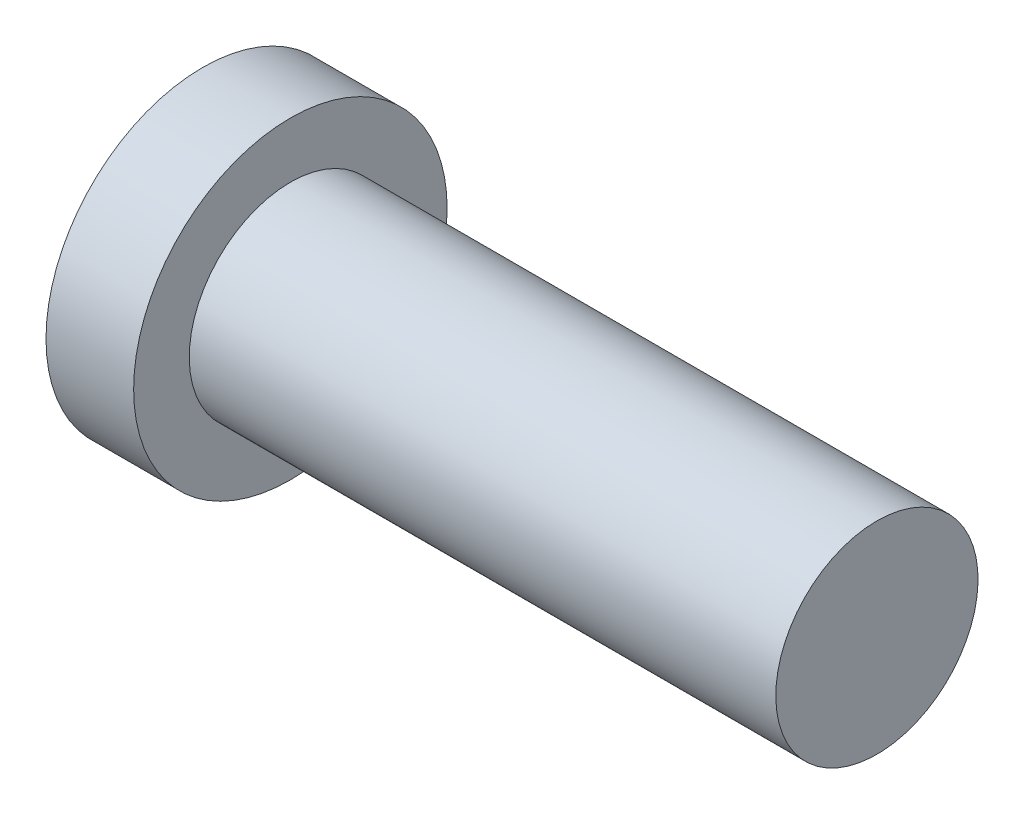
ISO-10303-21;
HEADER;
FILE_DESCRIPTION(('STEP AP214'),'2;1');
FILE_NAME('part.step','',(''),(''),'','','');
FILE_SCHEMA(('AUTOMOTIVE_DESIGN { 1 0 10303 214 1 1 1 1 }'));
ENDSEC;
DATA;
#1=APPLICATION_CONTEXT('core data for automotive mechanical design processes');
#2=APPLICATION_PROTOCOL_DEFINITION('international standard','automotive_design',2000,#1);
#3=PRODUCT_CONTEXT('',#1,'mechanical');
#4=PRODUCT('Part','Part','',(#3));
#5=PRODUCT_RELATED_PRODUCT_CATEGORY('part','',(#4));
#6=PRODUCT_DEFINITION_FORMATION('','',#4);
#7=PRODUCT_DEFINITION_CONTEXT('part definition',#1,'design');
#8=PRODUCT_DEFINITION('design','',#6,#7);
#9=PRODUCT_DEFINITION_SHAPE('','',#8);
#10=(LENGTH_UNIT() NAMED_UNIT(*) SI_UNIT(.MILLI.,.METRE.));
#11=(NAMED_UNIT(*) PLANE_ANGLE_UNIT() SI_UNIT($,.RADIAN.));
#12=(NAMED_UNIT(*) SI_UNIT($,.STERADIAN.) SOLID_ANGLE_UNIT());
#13=UNCERTAINTY_MEASURE_WITH_UNIT(LENGTH_MEASURE(1.E-05),#10,'distance_accuracy_value','');
#14=(GEOMETRIC_REPRESENTATION_CONTEXT(3) GLOBAL_UNCERTAINTY_ASSIGNED_CONTEXT((#13)) GLOBAL_UNIT_ASSIGNED_CONTEXT((#10,
#11,#12)) REPRESENTATION_CONTEXT('',''));
#15=CARTESIAN_POINT('',(0.,0.,0.));
#16=DIRECTION('',(0.,0.,1.));
#17=DIRECTION('',(1.,0.,0.));
#18=AXIS2_PLACEMENT_3D('',#15,#16,#17);
#19=CARTESIAN_POINT('',(10.7333766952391,-1.5,0.));
#20=DIRECTION('',(-1.,0.,0.));
#21=DIRECTION('',(0.,-1.,0.));
#22=AXIS2_PLACEMENT_3D('',#19,#20,#21);
#23=PLANE('',#22);
#24=CARTESIAN_POINT('',(10.7333766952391,0.,0.));
#25=DIRECTION('',(1.,0.,0.));
#26=DIRECTION('',(0.,1.,0.));
#27=AXIS2_PLACEMENT_3D('',#24,#25,#26);
#28=CIRCLE('',#27,1.5);
#29=CARTESIAN_POINT('',(10.7333766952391,1.5,0.));
#30=VERTEX_POINT('',#29);
#31=EDGE_CURVE('E10',#30,#30,#28,.T.);
#32=ORIENTED_EDGE('',*,*,#31,.T.);
#33=EDGE_LOOP('',(#32));
#34=FACE_BOUND('',#33,.T.);
#35=ADVANCED_FACE('F30',(#34),#23,.F.);
#36=CARTESIAN_POINT('',(28.9873686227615,0.,0.));
#37=DIRECTION('',(1.,0.,0.));
#38=DIRECTION('',(0.,1.,0.));
#39=AXIS2_PLACEMENT_3D('',#36,#37,#38);
#40=CYLINDRICAL_SURFACE('',#39,1.5);
#41=ORIENTED_EDGE('',*,*,#31,.F.);
#42=EDGE_LOOP('',(#41));
#43=FACE_BOUND('',#42,.T.);
#44=CARTESIAN_POINT('',(2.03337669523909,0.,0.));
#45=DIRECTION('',(1.,0.,0.));
#46=DIRECTION('',(0.,1.,0.));
#47=AXIS2_PLACEMENT_3D('',#44,#45,#46);
#48=CIRCLE('',#47,1.5);
#49=CARTESIAN_POINT('',(2.03337669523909,1.5,0.));
#50=VERTEX_POINT('',#49);
#51=EDGE_CURVE('E36',#50,#50,#48,.T.);
#52=ORIENTED_EDGE('',*,*,#51,.T.);
#53=EDGE_LOOP('',(#52));
#54=FACE_BOUND('',#53,.T.);
#55=ADVANCED_FACE('F71',(#43,#54),#40,.T.);
#56=CARTESIAN_POINT('',(2.03337669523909,-2.325,0.));
#57=DIRECTION('',(-1.,0.,0.));
#58=DIRECTION('',(0.,-1.,0.));
#59=AXIS2_PLACEMENT_3D('',#56,#57,#58);
#60=PLANE('',#59);
#61=ORIENTED_EDGE('',*,*,#51,.F.);
#62=EDGE_LOOP('',(#61));
#63=FACE_BOUND('',#62,.T.);
#64=CARTESIAN_POINT('',(2.03337669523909,0.,0.));
#65=DIRECTION('',(1.,0.,0.));
#66=DIRECTION('',(0.,1.,0.));
#67=AXIS2_PLACEMENT_3D('',#64,#65,#66);
#68=CIRCLE('',#67,2.325);
#69=CARTESIAN_POINT('',(2.03337669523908,2.325,0.));
#70=VERTEX_POINT('',#69);
#71=EDGE_CURVE('E40',#70,#70,#68,.T.);
#72=ORIENTED_EDGE('',*,*,#71,.T.);
#73=EDGE_LOOP('',(#72));
#74=FACE_BOUND('',#73,.T.);
#75=ADVANCED_FACE('F75',(#63,#74),#60,.F.);
#76=CARTESIAN_POINT('',(28.9873686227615,0.,0.));
#77=DIRECTION('',(1.,0.,0.));
#78=DIRECTION('',(0.,1.,0.));
#79=AXIS2_PLACEMENT_3D('',#76,#77,#78);
#80=CYLINDRICAL_SURFACE('',#79,2.325);
#81=ORIENTED_EDGE('',*,*,#71,.F.);
#82=EDGE_LOOP('',(#81));
#83=FACE_BOUND('',#82,.T.);
#84=CARTESIAN_POINT('',(0.733376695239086,0.,0.));
#85=DIRECTION('',(1.,0.,0.));
#86=DIRECTION('',(0.,1.,0.));
#87=AXIS2_PLACEMENT_3D('',#84,#85,#86);
#88=CIRCLE('',#87,2.325);
#89=CARTESIAN_POINT('',(0.733376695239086,2.325,0.));
#90=VERTEX_POINT('',#89);
#91=EDGE_CURVE('E44',#90,#90,#88,.T.);
#92=ORIENTED_EDGE('',*,*,#91,.T.);
#93=EDGE_LOOP('',(#92));
#94=FACE_BOUND('',#93,.T.);
#95=ADVANCED_FACE('F80',(#83,#94),#80,.T.);
#96=CARTESIAN_POINT('',(0.554941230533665,0.,0.));
#97=DIRECTION('',(1.,0.,0.));
#98=DIRECTION('',(0.,1.,0.));
#99=AXIS2_PLACEMENT_3D('',#96,#97,#98);
#100=CONICAL_SURFACE('',#99,0.627299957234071,1.46607657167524);
#101=CARTESIAN_POINT('',(0.554941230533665,0.,0.));
#102=DIRECTION('',(1.,0.,0.));
#103=DIRECTION('',(0.,1.,0.));
#104=AXIS2_PLACEMENT_3D('',#101,#102,#103);
#105=CIRCLE('',#104,0.627299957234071);
#106=CARTESIAN_POINT('',(0.554941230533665,0.627299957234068,0.));
#107=VERTEX_POINT('',#106);
#108=EDGE_CURVE('E49',#107,#107,#105,.T.);
#109=CARTESIAN_POINT('',(0.733376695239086,2.325,0.));
#110=CARTESIAN_POINT('',(0.731517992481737,2.30731562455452,0.));
#111=CARTESIAN_POINT('',(0.729659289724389,2.28963124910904,0.));
#112=CARTESIAN_POINT('',(0.725941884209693,2.25426249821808,0.));
#113=CARTESIAN_POINT('',(0.724083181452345,2.2365781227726,0.));
#114=CARTESIAN_POINT('',(0.720365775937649,2.20120937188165,0.));
#115=CARTESIAN_POINT('',(0.7185070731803,2.18352499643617,0.));
#116=CARTESIAN_POINT('',(0.714789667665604,2.14815624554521,0.));
#117=CARTESIAN_POINT('',(0.712930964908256,2.13047187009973,0.));
#118=CARTESIAN_POINT('',(0.70921355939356,2.09510311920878,0.));
#119=CARTESIAN_POINT('',(0.707354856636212,2.0774187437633,0.));
#120=CARTESIAN_POINT('',(0.703637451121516,2.04204999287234,0.));
#121=CARTESIAN_POINT('',(0.701778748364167,2.02436561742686,0.));
#122=CARTESIAN_POINT('',(0.698061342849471,1.98899686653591,0.));
#123=CARTESIAN_POINT('',(0.696202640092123,1.97131249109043,0.));
#124=CARTESIAN_POINT('',(0.692485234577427,1.93594374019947,0.));
#125=CARTESIAN_POINT('',(0.690626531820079,1.91825936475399,0.));
#126=CARTESIAN_POINT('',(0.686909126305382,1.88289061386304,0.));
#127=CARTESIAN_POINT('',(0.685050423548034,1.86520623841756,0.));
#128=CARTESIAN_POINT('',(0.681333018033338,1.8298374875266,0.));
#129=CARTESIAN_POINT('',(0.67947431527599,1.81215311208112,0.));
#130=CARTESIAN_POINT('',(0.675756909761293,1.77678436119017,0.));
#131=CARTESIAN_POINT('',(0.673898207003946,1.75909998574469,0.));
#132=CARTESIAN_POINT('',(0.670180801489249,1.72373123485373,0.));
#133=CARTESIAN_POINT('',(0.668322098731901,1.70604685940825,0.));
#134=CARTESIAN_POINT('',(0.664604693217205,1.67067810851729,0.));
#135=CARTESIAN_POINT('',(0.662745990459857,1.65299373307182,0.));
#136=CARTESIAN_POINT('',(0.65902858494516,1.61762498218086,0.));
#137=CARTESIAN_POINT('',(0.657169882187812,1.59994060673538,0.));
#138=CARTESIAN_POINT('',(0.653452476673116,1.56457185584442,0.));
#139=CARTESIAN_POINT('',(0.651593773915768,1.54688748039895,0.));
#140=CARTESIAN_POINT('',(0.647876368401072,1.51151872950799,0.));
#141=CARTESIAN_POINT('',(0.646017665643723,1.49383435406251,0.));
#142=CARTESIAN_POINT('',(0.642300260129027,1.45846560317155,0.));
#143=CARTESIAN_POINT('',(0.640441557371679,1.44078122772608,0.));
#144=CARTESIAN_POINT('',(0.636724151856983,1.40541247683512,0.));
#145=CARTESIAN_POINT('',(0.634865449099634,1.38772810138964,0.));
#146=CARTESIAN_POINT('',(0.631148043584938,1.35235935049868,0.));
#147=CARTESIAN_POINT('',(0.62928934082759,1.3346749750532,0.));
#148=CARTESIAN_POINT('',(0.625571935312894,1.29930622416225,0.));
#149=CARTESIAN_POINT('',(0.623713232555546,1.28162184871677,0.));
#150=CARTESIAN_POINT('',(0.619995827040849,1.24625309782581,0.));
#151=CARTESIAN_POINT('',(0.618137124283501,1.22856872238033,0.));
#152=CARTESIAN_POINT('',(0.614419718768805,1.19319997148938,0.));
#153=CARTESIAN_POINT('',(0.612561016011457,1.1755155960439,0.));
#154=CARTESIAN_POINT('',(0.608843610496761,1.14014684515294,0.));
#155=CARTESIAN_POINT('',(0.606984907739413,1.12246246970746,0.));
#156=CARTESIAN_POINT('',(0.603267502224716,1.08709371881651,0.));
#157=CARTESIAN_POINT('',(0.601408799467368,1.06940934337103,0.));
#158=CARTESIAN_POINT('',(0.597691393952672,1.03404059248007,0.));
#159=CARTESIAN_POINT('',(0.595832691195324,1.01635621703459,0.));
#160=CARTESIAN_POINT('',(0.592115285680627,0.980987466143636,0.));
#161=CARTESIAN_POINT('',(0.590256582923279,0.963303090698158,0.));
#162=CARTESIAN_POINT('',(0.586539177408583,0.927934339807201,0.));
#163=CARTESIAN_POINT('',(0.584680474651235,0.910249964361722,0.));
#164=CARTESIAN_POINT('',(0.580963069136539,0.874881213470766,0.));
#165=CARTESIAN_POINT('',(0.579104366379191,0.857196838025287,0.));
#166=CARTESIAN_POINT('',(0.575386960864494,0.82182808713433,0.));
#167=CARTESIAN_POINT('',(0.573528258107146,0.804143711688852,0.));
#168=CARTESIAN_POINT('',(0.56981085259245,0.768774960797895,0.));
#169=CARTESIAN_POINT('',(0.567952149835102,0.751090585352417,0.));
#170=CARTESIAN_POINT('',(0.564234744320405,0.71572183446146,0.));
#171=CARTESIAN_POINT('',(0.562376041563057,0.698037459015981,0.));
#172=CARTESIAN_POINT('',(0.558658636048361,0.662668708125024,0.));
#173=CARTESIAN_POINT('',(0.556799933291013,0.644984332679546,0.));
#174=CARTESIAN_POINT('',(0.554941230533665,0.627299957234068,0.));
#175=B_SPLINE_CURVE_WITH_KNOTS('',3,(#109,#110,#111,#112,#113,#114,#115,#116,#117,#118,#119,
#120,#121,#122,#123,#124,#125,#126,#127,#128,#129,#130,#131,#132,#133,#134,#135,#136,#137,#138,
#139,#140,#141,#142,#143,#144,#145,#146,#147,#148,#149,#150,#151,#152,#153,#154,#155,#156,#157,
#158,#159,#160,#161,#162,#163,#164,#165,#166,#167,#168,#169,#170,#171,#172,#173,#174),
.UNSPECIFIED.,.F.,.F.,(4,2,2,2,2,2,2,2,2,2,2,2,2,2,2,2,2,2,2,2,2,2,2,2,2,2,2,2,2,2,2,2,4),(0.,
0.0533453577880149,0.10669071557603,0.160036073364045,0.21338143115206,0.266726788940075,
0.320072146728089,0.373417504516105,0.426762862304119,0.480108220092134,0.533453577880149,
0.586798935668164,0.640144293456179,0.693489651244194,0.746835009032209,0.800180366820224,
0.853525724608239,0.906871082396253,0.960216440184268,1.01356179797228,1.0669071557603,
1.12025251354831,1.17359787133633,1.22694322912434,1.28028858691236,1.33363394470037,
1.38697930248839,1.4403246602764,1.49367001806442,1.54701537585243,1.60036073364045,
1.65370609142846,1.70705144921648),.UNSPECIFIED.);
#176=EDGE_CURVE('BSEAM86',#90,#107,#175,.T.);
#177=ORIENTED_EDGE('',*,*,#91,.F.);
#178=ORIENTED_EDGE('',*,*,#108,.T.);
#179=ORIENTED_EDGE('',*,*,#176,.T.);
#180=ORIENTED_EDGE('',*,*,#176,.F.);
#181=EDGE_LOOP('',(#177,#179,#178,#180));
#182=FACE_BOUND('',#181,.T.);
#183=ADVANCED_FACE('F86',(#182),#100,.T.);
#184=CARTESIAN_POINT('',(0.291392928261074,0.,0.));
#185=DIRECTION('',(1.,0.,0.));
#186=DIRECTION('',(0.,1.,0.));
#187=AXIS2_PLACEMENT_3D('',#184,#185,#186);
#188=TOROIDAL_SURFACE('',#187,0.654999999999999,0.265);
#189=ORIENTED_EDGE('',*,*,#108,.F.);
#190=EDGE_LOOP('',(#189));
#191=FACE_BOUND('',#190,.T.);
#192=CARTESIAN_POINT('',(0.291392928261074,0.,0.));
#193=DIRECTION('',(1.,0.,0.));
#194=DIRECTION('',(0.,1.,0.));
#195=AXIS2_PLACEMENT_3D('',#192,#193,#194);
#196=CIRCLE('',#195,0.389999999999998);
#197=CARTESIAN_POINT('',(0.291392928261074,0.389999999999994,0.));
#198=VERTEX_POINT('',#197);
#199=EDGE_CURVE('E52',#198,#198,#196,.T.);
#200=ORIENTED_EDGE('',*,*,#199,.T.);
#201=EDGE_LOOP('',(#200));
#202=FACE_BOUND('',#201,.T.);
#203=ADVANCED_FACE('F67',(#191,#202),#188,.F.);
#204=CARTESIAN_POINT('',(28.9873686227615,0.,0.));
#205=DIRECTION('',(1.,0.,0.));
#206=DIRECTION('',(0.,1.,0.));
#207=AXIS2_PLACEMENT_3D('',#204,#205,#206);
#208=CYLINDRICAL_SURFACE('',#207,0.389999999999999);
#209=ORIENTED_EDGE('',*,*,#199,.F.);
#210=EDGE_LOOP('',(#209));
#211=FACE_BOUND('',#210,.T.);
#212=CARTESIAN_POINT('',(0.,0.,0.));
#213=DIRECTION('',(1.,0.,0.));
#214=DIRECTION('',(0.,1.,0.));
#215=AXIS2_PLACEMENT_3D('',#212,#213,#214);
#216=CIRCLE('',#215,0.390000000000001);
#217=CARTESIAN_POINT('',(0.,0.389999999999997,0.));
#218=VERTEX_POINT('',#217);
#219=EDGE_CURVE('E55',#218,#218,#216,.T.);
#220=ORIENTED_EDGE('',*,*,#219,.T.);
#221=EDGE_LOOP('',(#220));
#222=FACE_BOUND('',#221,.T.);
#223=ADVANCED_FACE('F59',(#211,#222),#208,.T.);
#224=CARTESIAN_POINT('',(0.,0.,0.));
#225=DIRECTION('',(1.,0.,0.));
#226=DIRECTION('',(0.,1.,0.));
#227=AXIS2_PLACEMENT_3D('',#224,#225,#226);
#228=PLANE('',#227);
#229=ORIENTED_EDGE('',*,*,#219,.F.);
#230=EDGE_LOOP('',(#229));
#231=FACE_BOUND('',#230,.T.);
#232=ADVANCED_FACE('F61',(#231),#228,.F.);
#233=CLOSED_SHELL('',(#35,#55,#75,#95,#183,#203,#223,#232));
#234=MANIFOLD_SOLID_BREP('B2',#233);
#235=ADVANCED_BREP_SHAPE_REPRESENTATION('',(#18,#234),#14);
#236=SHAPE_DEFINITION_REPRESENTATION(#9,#235);
ENDSEC;
END-ISO-10303-21;
